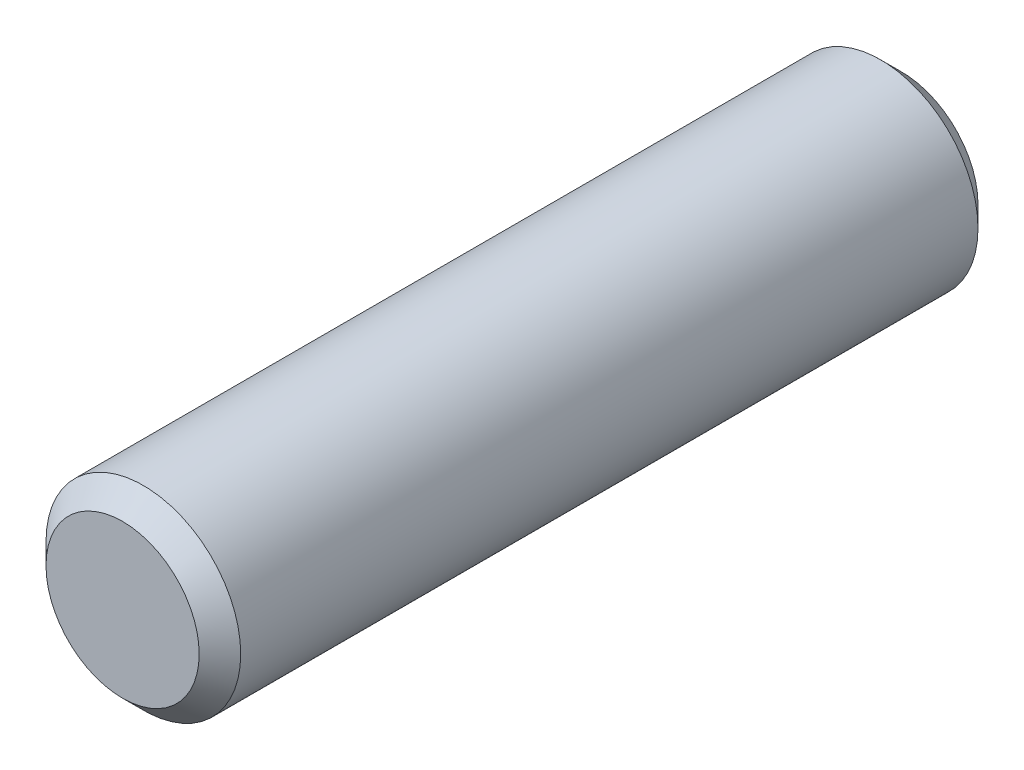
ISO-10303-21;
HEADER;
FILE_DESCRIPTION(('STEP AP214'),'2;1');
FILE_NAME('part.step','',(''),(''),'','','');
FILE_SCHEMA(('AUTOMOTIVE_DESIGN { 1 0 10303 214 1 1 1 1 }'));
ENDSEC;
DATA;
#1=APPLICATION_CONTEXT('core data for automotive mechanical design processes');
#2=APPLICATION_PROTOCOL_DEFINITION('international standard','automotive_design',2000,#1);
#3=PRODUCT_CONTEXT('',#1,'mechanical');
#4=PRODUCT('Part','Part','',(#3));
#5=PRODUCT_RELATED_PRODUCT_CATEGORY('part','',(#4));
#6=PRODUCT_DEFINITION_FORMATION('','',#4);
#7=PRODUCT_DEFINITION_CONTEXT('part definition',#1,'design');
#8=PRODUCT_DEFINITION('design','',#6,#7);
#9=PRODUCT_DEFINITION_SHAPE('','',#8);
#10=(LENGTH_UNIT() NAMED_UNIT(*) SI_UNIT(.MILLI.,.METRE.));
#11=(NAMED_UNIT(*) PLANE_ANGLE_UNIT() SI_UNIT($,.RADIAN.));
#12=(NAMED_UNIT(*) SI_UNIT($,.STERADIAN.) SOLID_ANGLE_UNIT());
#13=UNCERTAINTY_MEASURE_WITH_UNIT(LENGTH_MEASURE(1.E-05),#10,'distance_accuracy_value','');
#14=(GEOMETRIC_REPRESENTATION_CONTEXT(3) GLOBAL_UNCERTAINTY_ASSIGNED_CONTEXT((#13)) GLOBAL_UNIT_ASSIGNED_CONTEXT((#10,
#11,#12)) REPRESENTATION_CONTEXT('',''));
#15=CARTESIAN_POINT('',(0.,0.,0.));
#16=DIRECTION('',(0.,0.,1.));
#17=DIRECTION('',(1.,0.,0.));
#18=AXIS2_PLACEMENT_3D('',#15,#16,#17);
#19=CARTESIAN_POINT('',(0.,0.,9.525));
#20=DIRECTION('',(0.,0.,-1.));
#21=DIRECTION('',(-1.,0.,0.));
#22=AXIS2_PLACEMENT_3D('',#19,#20,#21);
#23=CYLINDRICAL_SURFACE('',#22,2.38125);
#24=CARTESIAN_POINT('',(0.,0.,-9.01699999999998));
#25=DIRECTION('',(0.,0.,1.));
#26=DIRECTION('',(1.,0.,0.));
#27=AXIS2_PLACEMENT_3D('',#24,#25,#26);
#28=CIRCLE('',#27,2.38125);
#29=CARTESIAN_POINT('',(-2.38125,0.,-9.01699999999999));
#30=VERTEX_POINT('',#29);
#31=EDGE_CURVE('E43',#30,#30,#28,.T.);
#32=CARTESIAN_POINT('',(0.,0.,9.01700000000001));
#33=DIRECTION('',(0.,0.,1.));
#34=DIRECTION('',(1.,0.,0.));
#35=AXIS2_PLACEMENT_3D('',#32,#33,#34);
#36=CIRCLE('',#35,2.38125);
#37=CARTESIAN_POINT('',(-2.38125,0.,9.01700000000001));
#38=VERTEX_POINT('',#37);
#39=EDGE_CURVE('E47',#38,#38,#36,.F.);
#40=CARTESIAN_POINT('',(-2.38125,0.,-9.01699999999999));
#41=CARTESIAN_POINT('',(-2.38125,0.,-8.82914583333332));
#42=CARTESIAN_POINT('',(-2.38125,0.,-8.64129166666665));
#43=CARTESIAN_POINT('',(-2.38125,0.,-8.26558333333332));
#44=CARTESIAN_POINT('',(-2.38125,0.,-8.07772916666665));
#45=CARTESIAN_POINT('',(-2.38125,0.,-7.70202083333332));
#46=CARTESIAN_POINT('',(-2.38125,0.,-7.51416666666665));
#47=CARTESIAN_POINT('',(-2.38125,0.,-7.13845833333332));
#48=CARTESIAN_POINT('',(-2.38125,0.,-6.95060416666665));
#49=CARTESIAN_POINT('',(-2.38125,0.,-6.57489583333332));
#50=CARTESIAN_POINT('',(-2.38125,0.,-6.38704166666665));
#51=CARTESIAN_POINT('',(-2.38125,0.,-6.01133333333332));
#52=CARTESIAN_POINT('',(-2.38125,0.,-5.82347916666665));
#53=CARTESIAN_POINT('',(-2.38125,0.,-5.44777083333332));
#54=CARTESIAN_POINT('',(-2.38125,0.,-5.25991666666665));
#55=CARTESIAN_POINT('',(-2.38125,0.,-4.88420833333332));
#56=CARTESIAN_POINT('',(-2.38125,0.,-4.69635416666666));
#57=CARTESIAN_POINT('',(-2.38125,0.,-4.32064583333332));
#58=CARTESIAN_POINT('',(-2.38125,0.,-4.13279166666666));
#59=CARTESIAN_POINT('',(-2.38125,0.,-3.75708333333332));
#60=CARTESIAN_POINT('',(-2.38125,0.,-3.56922916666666));
#61=CARTESIAN_POINT('',(-2.38125,0.,-3.19352083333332));
#62=CARTESIAN_POINT('',(-2.38125,0.,-3.00566666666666));
#63=CARTESIAN_POINT('',(-2.38125,0.,-2.62995833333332));
#64=CARTESIAN_POINT('',(-2.38125,0.,-2.44210416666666));
#65=CARTESIAN_POINT('',(-2.38125,0.,-2.06639583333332));
#66=CARTESIAN_POINT('',(-2.38125,0.,-1.87854166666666));
#67=CARTESIAN_POINT('',(-2.38125,0.,-1.50283333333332));
#68=CARTESIAN_POINT('',(-2.38125,0.,-1.31497916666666));
#69=CARTESIAN_POINT('',(-2.38125,0.,-0.939270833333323));
#70=CARTESIAN_POINT('',(-2.38125,0.,-0.751416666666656));
#71=CARTESIAN_POINT('',(-2.38125,0.,-0.375708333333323));
#72=CARTESIAN_POINT('',(-2.38125,0.,-0.187854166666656));
#73=CARTESIAN_POINT('',(-2.38125,0.,0.187854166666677));
#74=CARTESIAN_POINT('',(-2.38125,0.,0.375708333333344));
#75=CARTESIAN_POINT('',(-2.38125,0.,0.751416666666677));
#76=CARTESIAN_POINT('',(-2.38125,0.,0.939270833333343));
#77=CARTESIAN_POINT('',(-2.38125,0.,1.31497916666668));
#78=CARTESIAN_POINT('',(-2.38125,0.,1.50283333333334));
#79=CARTESIAN_POINT('',(-2.38125,0.,1.87854166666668));
#80=CARTESIAN_POINT('',(-2.38125,0.,2.06639583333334));
#81=CARTESIAN_POINT('',(-2.38125,0.,2.44210416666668));
#82=CARTESIAN_POINT('',(-2.38125,0.,2.62995833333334));
#83=CARTESIAN_POINT('',(-2.38125,0.,3.00566666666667));
#84=CARTESIAN_POINT('',(-2.38125,0.,3.19352083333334));
#85=CARTESIAN_POINT('',(-2.38125,0.,3.56922916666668));
#86=CARTESIAN_POINT('',(-2.38125,0.,3.75708333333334));
#87=CARTESIAN_POINT('',(-2.38125,0.,4.13279166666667));
#88=CARTESIAN_POINT('',(-2.38125,0.,4.32064583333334));
#89=CARTESIAN_POINT('',(-2.38125,0.,4.69635416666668));
#90=CARTESIAN_POINT('',(-2.38125,0.,4.88420833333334));
#91=CARTESIAN_POINT('',(-2.38125,0.,5.25991666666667));
#92=CARTESIAN_POINT('',(-2.38125,0.,5.44777083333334));
#93=CARTESIAN_POINT('',(-2.38125,0.,5.82347916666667));
#94=CARTESIAN_POINT('',(-2.38125,0.,6.01133333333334));
#95=CARTESIAN_POINT('',(-2.38125,0.,6.38704166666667));
#96=CARTESIAN_POINT('',(-2.38125,0.,6.57489583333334));
#97=CARTESIAN_POINT('',(-2.38125,0.,6.95060416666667));
#98=CARTESIAN_POINT('',(-2.38125,0.,7.13845833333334));
#99=CARTESIAN_POINT('',(-2.38125,0.,7.51416666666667));
#100=CARTESIAN_POINT('',(-2.38125,0.,7.70202083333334));
#101=CARTESIAN_POINT('',(-2.38125,0.,8.07772916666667));
#102=CARTESIAN_POINT('',(-2.38125,0.,8.26558333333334));
#103=CARTESIAN_POINT('',(-2.38125,0.,8.64129166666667));
#104=CARTESIAN_POINT('',(-2.38125,0.,8.82914583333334));
#105=CARTESIAN_POINT('',(-2.38125,0.,9.01700000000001));
#106=B_SPLINE_CURVE_WITH_KNOTS('',3,(#40,#41,#42,#43,#44,#45,#46,#47,#48,#49,#50,#51,#52,#53,
#54,#55,#56,#57,#58,#59,#60,#61,#62,#63,#64,#65,#66,#67,#68,#69,#70,#71,#72,#73,#74,#75,#76,#77,
#78,#79,#80,#81,#82,#83,#84,#85,#86,#87,#88,#89,#90,#91,#92,#93,#94,#95,#96,#97,#98,#99,#100,
#101,#102,#103,#104,#105),.UNSPECIFIED.,.F.,.F.,(4,2,2,2,2,2,2,2,2,2,2,2,2,2,2,2,2,2,2,2,2,2,2,
2,2,2,2,2,2,2,2,2,4),(0.,0.5635625,1.127125,1.6906875,2.25425,2.8178125,3.381375,3.9449375,
4.5085,5.0720625,5.635625,6.1991875,6.76275,7.3263125,7.889875,8.4534375,9.017,9.5805625,
10.144125,10.7076875,11.27125,11.8348125,12.398375,12.9619375,13.5255,14.0890625,14.652625,
15.2161875,15.77975,16.3433125,16.906875,17.4704375,18.034),.UNSPECIFIED.);
#107=EDGE_CURVE('BSEAM33',#30,#38,#106,.T.);
#108=ORIENTED_EDGE('',*,*,#31,.T.);
#109=ORIENTED_EDGE('',*,*,#39,.T.);
#110=ORIENTED_EDGE('',*,*,#107,.T.);
#111=ORIENTED_EDGE('',*,*,#107,.F.);
#112=EDGE_LOOP('',(#108,#110,#109,#111));
#113=FACE_BOUND('',#112,.T.);
#114=ADVANCED_FACE('F33',(#113),#23,.T.);
#115=CARTESIAN_POINT('',(0.,0.,9.525));
#116=DIRECTION('',(0.,0.,1.));
#117=DIRECTION('',(1.,0.,0.));
#118=AXIS2_PLACEMENT_3D('',#115,#116,#117);
#119=PLANE('',#118);
#120=CARTESIAN_POINT('',(0.,0.,9.525));
#121=DIRECTION('',(0.,0.,1.));
#122=DIRECTION('',(1.,0.,0.));
#123=AXIS2_PLACEMENT_3D('',#120,#121,#122);
#124=CIRCLE('',#123,1.87325000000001);
#125=CARTESIAN_POINT('',(1.87325000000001,0.,9.525));
#126=VERTEX_POINT('',#125);
#127=EDGE_CURVE('E10',#126,#126,#124,.T.);
#128=ORIENTED_EDGE('',*,*,#127,.T.);
#129=EDGE_LOOP('',(#128));
#130=FACE_BOUND('',#129,.T.);
#131=ADVANCED_FACE('F66',(#130),#119,.T.);
#132=CARTESIAN_POINT('',(0.,0.,-9.525));
#133=DIRECTION('',(0.,0.,1.));
#134=DIRECTION('',(1.,0.,0.));
#135=AXIS2_PLACEMENT_3D('',#132,#133,#134);
#136=PLANE('',#135);
#137=CARTESIAN_POINT('',(0.,0.,-9.525));
#138=DIRECTION('',(0.,0.,1.));
#139=DIRECTION('',(1.,0.,0.));
#140=AXIS2_PLACEMENT_3D('',#137,#138,#139);
#141=CIRCLE('',#140,1.87324999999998);
#142=CARTESIAN_POINT('',(1.87324999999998,0.,-9.525));
#143=VERTEX_POINT('',#142);
#144=EDGE_CURVE('E39',#143,#143,#141,.F.);
#145=ORIENTED_EDGE('',*,*,#144,.T.);
#146=EDGE_LOOP('',(#145));
#147=FACE_BOUND('',#146,.T.);
#148=ADVANCED_FACE('F62',(#147),#136,.F.);
#149=CARTESIAN_POINT('',(0.,0.,-9.01699999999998));
#150=DIRECTION('',(0.,0.,1.));
#151=DIRECTION('',(1.,0.,0.));
#152=AXIS2_PLACEMENT_3D('',#149,#150,#151);
#153=CONICAL_SURFACE('',#152,2.38125,0.785398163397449);
#154=ORIENTED_EDGE('',*,*,#144,.F.);
#155=EDGE_LOOP('',(#154));
#156=FACE_BOUND('',#155,.T.);
#157=ORIENTED_EDGE('',*,*,#31,.F.);
#158=EDGE_LOOP('',(#157));
#159=FACE_BOUND('',#158,.T.);
#160=ADVANCED_FACE('F57',(#156,#159),#153,.T.);
#161=CARTESIAN_POINT('',(0.,0.,9.525));
#162=DIRECTION('',(0.,0.,-1.));
#163=DIRECTION('',(-1.,0.,0.));
#164=AXIS2_PLACEMENT_3D('',#161,#162,#163);
#165=CONICAL_SURFACE('',#164,1.87325000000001,0.785398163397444);
#166=ORIENTED_EDGE('',*,*,#39,.F.);
#167=EDGE_LOOP('',(#166));
#168=FACE_BOUND('',#167,.T.);
#169=ORIENTED_EDGE('',*,*,#127,.F.);
#170=EDGE_LOOP('',(#169));
#171=FACE_BOUND('',#170,.T.);
#172=ADVANCED_FACE('F54',(#168,#171),#165,.T.);
#173=CLOSED_SHELL('',(#114,#131,#148,#160,#172));
#174=MANIFOLD_SOLID_BREP('B2',#173);
#175=ADVANCED_BREP_SHAPE_REPRESENTATION('',(#18,#174),#14);
#176=SHAPE_DEFINITION_REPRESENTATION(#9,#175);
ENDSEC;
END-ISO-10303-21;
